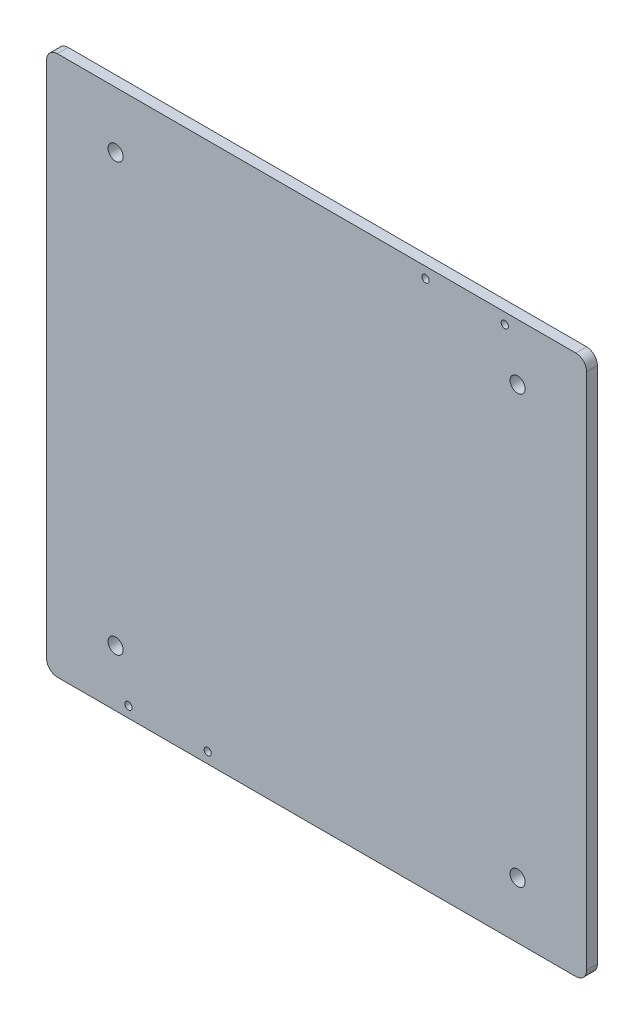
ISO-10303-21;
HEADER;
FILE_DESCRIPTION(('STEP AP214'),'2;1');
FILE_NAME('part.step','',(''),(''),'','','');
FILE_SCHEMA(('AUTOMOTIVE_DESIGN { 1 0 10303 214 1 1 1 1 }'));
ENDSEC;
DATA;
#1=APPLICATION_CONTEXT('core data for automotive mechanical design processes');
#2=APPLICATION_PROTOCOL_DEFINITION('international standard','automotive_design',2000,#1);
#3=PRODUCT_CONTEXT('',#1,'mechanical');
#4=PRODUCT('Part','Part','',(#3));
#5=PRODUCT_RELATED_PRODUCT_CATEGORY('part','',(#4));
#6=PRODUCT_DEFINITION_FORMATION('','',#4);
#7=PRODUCT_DEFINITION_CONTEXT('part definition',#1,'design');
#8=PRODUCT_DEFINITION('design','',#6,#7);
#9=PRODUCT_DEFINITION_SHAPE('','',#8);
#10=(LENGTH_UNIT() NAMED_UNIT(*) SI_UNIT(.MILLI.,.METRE.));
#11=(NAMED_UNIT(*) PLANE_ANGLE_UNIT() SI_UNIT($,.RADIAN.));
#12=(NAMED_UNIT(*) SI_UNIT($,.STERADIAN.) SOLID_ANGLE_UNIT());
#13=UNCERTAINTY_MEASURE_WITH_UNIT(LENGTH_MEASURE(1.E-05),#10,'distance_accuracy_value','');
#14=(GEOMETRIC_REPRESENTATION_CONTEXT(3) GLOBAL_UNCERTAINTY_ASSIGNED_CONTEXT((#13)) GLOBAL_UNIT_ASSIGNED_CONTEXT((#10,
#11,#12)) REPRESENTATION_CONTEXT('',''));
#15=CARTESIAN_POINT('',(0.,0.,0.));
#16=DIRECTION('',(0.,0.,1.));
#17=DIRECTION('',(1.,0.,0.));
#18=AXIS2_PLACEMENT_3D('',#15,#16,#17);
#19=CARTESIAN_POINT('',(75.,-75.,3.));
#20=DIRECTION('',(-1.,0.,0.));
#21=DIRECTION('',(0.,0.,1.));
#22=AXIS2_PLACEMENT_3D('',#19,#20,#21);
#23=PLANE('',#22);
#24=DIRECTION('',(0.,1.,0.));
#25=VECTOR('',#24,1.);
#26=CARTESIAN_POINT('',(75.,-75.,3.));
#27=LINE('',#26,#25);
#28=CARTESIAN_POINT('',(75.,-72.,3.));
#29=VERTEX_POINT('',#28);
#30=CARTESIAN_POINT('',(75.,72.,3.));
#31=VERTEX_POINT('',#30);
#32=EDGE_CURVE('E121',#29,#31,#27,.T.);
#33=ORIENTED_EDGE('',*,*,#32,.F.);
#34=DIRECTION('',(0.,0.,-1.));
#35=VECTOR('',#34,1.);
#36=CARTESIAN_POINT('',(75.,-72.,3.));
#37=LINE('',#36,#35);
#38=CARTESIAN_POINT('',(75.,-72.,0.));
#39=VERTEX_POINT('',#38);
#40=EDGE_CURVE('E106',#29,#39,#37,.T.);
#41=ORIENTED_EDGE('',*,*,#40,.T.);
#42=DIRECTION('',(0.,1.,0.));
#43=VECTOR('',#42,1.);
#44=CARTESIAN_POINT('',(75.,-75.,0.));
#45=LINE('',#44,#43);
#46=CARTESIAN_POINT('',(75.,72.,0.));
#47=VERTEX_POINT('',#46);
#48=EDGE_CURVE('E118',#39,#47,#45,.T.);
#49=ORIENTED_EDGE('',*,*,#48,.T.);
#50=DIRECTION('',(0.,0.,-1.));
#51=VECTOR('',#50,1.);
#52=CARTESIAN_POINT('',(75.,72.,3.));
#53=LINE('',#52,#51);
#54=EDGE_CURVE('E123',#47,#31,#53,.F.);
#55=ORIENTED_EDGE('',*,*,#54,.T.);
#56=EDGE_LOOP('',(#33,#41,#49,#55));
#57=FACE_BOUND('',#56,.T.);
#58=ADVANCED_FACE('F36',(#57),#23,.F.);
#59=CARTESIAN_POINT('',(-75.,75.,3.));
#60=DIRECTION('',(0.,-1.,0.));
#61=DIRECTION('',(0.,0.,-1.));
#62=AXIS2_PLACEMENT_3D('',#59,#60,#61);
#63=PLANE('',#62);
#64=DIRECTION('',(-1.,0.,0.));
#65=VECTOR('',#64,1.);
#66=CARTESIAN_POINT('',(-75.,75.,0.));
#67=LINE('',#66,#65);
#68=CARTESIAN_POINT('',(72.,75.,0.));
#69=VERTEX_POINT('',#68);
#70=CARTESIAN_POINT('',(-72.,75.,0.));
#71=VERTEX_POINT('',#70);
#72=EDGE_CURVE('E127',#69,#71,#67,.T.);
#73=ORIENTED_EDGE('',*,*,#72,.T.);
#74=DIRECTION('',(0.,0.,-1.));
#75=VECTOR('',#74,1.);
#76=CARTESIAN_POINT('',(-72.,75.,3.));
#77=LINE('',#76,#75);
#78=CARTESIAN_POINT('',(-72.,75.,3.));
#79=VERTEX_POINT('',#78);
#80=EDGE_CURVE('E11',#71,#79,#77,.F.);
#81=ORIENTED_EDGE('',*,*,#80,.T.);
#82=DIRECTION('',(-1.,0.,0.));
#83=VECTOR('',#82,1.);
#84=CARTESIAN_POINT('',(-75.,75.,3.));
#85=LINE('',#84,#83);
#86=CARTESIAN_POINT('',(72.,75.,3.));
#87=VERTEX_POINT('',#86);
#88=EDGE_CURVE('E167',#87,#79,#85,.T.);
#89=ORIENTED_EDGE('',*,*,#88,.F.);
#90=DIRECTION('',(0.,0.,-1.));
#91=VECTOR('',#90,1.);
#92=CARTESIAN_POINT('',(72.,75.,3.));
#93=LINE('',#92,#91);
#94=EDGE_CURVE('E44',#87,#69,#93,.T.);
#95=ORIENTED_EDGE('',*,*,#94,.T.);
#96=EDGE_LOOP('',(#73,#81,#89,#95));
#97=FACE_BOUND('',#96,.T.);
#98=ADVANCED_FACE('F165',(#97),#63,.F.);
#99=CARTESIAN_POINT('',(-75.,-75.,3.));
#100=DIRECTION('',(1.,0.,0.));
#101=DIRECTION('',(0.,0.,-1.));
#102=AXIS2_PLACEMENT_3D('',#99,#100,#101);
#103=PLANE('',#102);
#104=DIRECTION('',(0.,-1.,0.));
#105=VECTOR('',#104,1.);
#106=CARTESIAN_POINT('',(-75.,-75.,0.));
#107=LINE('',#106,#105);
#108=CARTESIAN_POINT('',(-75.,72.,0.));
#109=VERTEX_POINT('',#108);
#110=CARTESIAN_POINT('',(-75.,-72.,0.));
#111=VERTEX_POINT('',#110);
#112=EDGE_CURVE('E131',#109,#111,#107,.T.);
#113=ORIENTED_EDGE('',*,*,#112,.T.);
#114=DIRECTION('',(0.,0.,-1.));
#115=VECTOR('',#114,1.);
#116=CARTESIAN_POINT('',(-75.,-72.,3.));
#117=LINE('',#116,#115);
#118=CARTESIAN_POINT('',(-75.,-72.,3.));
#119=VERTEX_POINT('',#118);
#120=EDGE_CURVE('E51',#111,#119,#117,.F.);
#121=ORIENTED_EDGE('',*,*,#120,.T.);
#122=DIRECTION('',(0.,-1.,0.));
#123=VECTOR('',#122,1.);
#124=CARTESIAN_POINT('',(-75.,-75.,3.));
#125=LINE('',#124,#123);
#126=CARTESIAN_POINT('',(-75.,72.,3.));
#127=VERTEX_POINT('',#126);
#128=EDGE_CURVE('E175',#127,#119,#125,.T.);
#129=ORIENTED_EDGE('',*,*,#128,.F.);
#130=DIRECTION('',(0.,0.,-1.));
#131=VECTOR('',#130,1.);
#132=CARTESIAN_POINT('',(-75.,72.,3.));
#133=LINE('',#132,#131);
#134=EDGE_CURVE('E158',#127,#109,#133,.T.);
#135=ORIENTED_EDGE('',*,*,#134,.T.);
#136=EDGE_LOOP('',(#113,#121,#129,#135));
#137=FACE_BOUND('',#136,.T.);
#138=ADVANCED_FACE('F174',(#137),#103,.F.);
#139=CARTESIAN_POINT('',(-75.,-75.,3.));
#140=DIRECTION('',(0.,1.,0.));
#141=DIRECTION('',(0.,0.,1.));
#142=AXIS2_PLACEMENT_3D('',#139,#140,#141);
#143=PLANE('',#142);
#144=DIRECTION('',(1.,0.,0.));
#145=VECTOR('',#144,1.);
#146=CARTESIAN_POINT('',(-75.,-75.,0.));
#147=LINE('',#146,#145);
#148=CARTESIAN_POINT('',(-72.,-75.,0.));
#149=VERTEX_POINT('',#148);
#150=CARTESIAN_POINT('',(72.,-75.,0.));
#151=VERTEX_POINT('',#150);
#152=EDGE_CURVE('E141',#149,#151,#147,.T.);
#153=ORIENTED_EDGE('',*,*,#152,.T.);
#154=DIRECTION('',(0.,0.,-1.));
#155=VECTOR('',#154,1.);
#156=CARTESIAN_POINT('',(72.,-75.,3.));
#157=LINE('',#156,#155);
#158=CARTESIAN_POINT('',(72.,-75.,3.));
#159=VERTEX_POINT('',#158);
#160=EDGE_CURVE('E107',#151,#159,#157,.F.);
#161=ORIENTED_EDGE('',*,*,#160,.T.);
#162=DIRECTION('',(1.,0.,0.));
#163=VECTOR('',#162,1.);
#164=CARTESIAN_POINT('',(-75.,-75.,3.));
#165=LINE('',#164,#163);
#166=CARTESIAN_POINT('',(-72.,-75.,3.));
#167=VERTEX_POINT('',#166);
#168=EDGE_CURVE('E137',#167,#159,#165,.T.);
#169=ORIENTED_EDGE('',*,*,#168,.F.);
#170=DIRECTION('',(0.,0.,-1.));
#171=VECTOR('',#170,1.);
#172=CARTESIAN_POINT('',(-72.,-75.,3.));
#173=LINE('',#172,#171);
#174=EDGE_CURVE('E112',#167,#149,#173,.T.);
#175=ORIENTED_EDGE('',*,*,#174,.T.);
#176=EDGE_LOOP('',(#153,#161,#169,#175));
#177=FACE_BOUND('',#176,.T.);
#178=ADVANCED_FACE('F327',(#177),#143,.F.);
#179=CARTESIAN_POINT('',(0.,0.,3.));
#180=DIRECTION('',(0.,0.,-1.));
#181=DIRECTION('',(-1.,0.,0.));
#182=AXIS2_PLACEMENT_3D('',#179,#180,#181);
#183=PLANE('',#182);
#184=CARTESIAN_POINT('',(52.26,72.,3.));
#185=DIRECTION('',(0.,0.,-1.));
#186=DIRECTION('',(-1.,0.,0.));
#187=AXIS2_PLACEMENT_3D('',#184,#185,#186);
#188=CIRCLE('',#187,0.999999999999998);
#189=CARTESIAN_POINT('',(51.26,72.,3.));
#190=VERTEX_POINT('',#189);
#191=EDGE_CURVE('E201',#190,#190,#188,.F.);
#192=ORIENTED_EDGE('',*,*,#191,.F.);
#193=EDGE_LOOP('',(#192));
#194=FACE_BOUND('',#193,.T.);
#195=CARTESIAN_POINT('',(-30.26,-72.,3.));
#196=DIRECTION('',(0.,0.,-1.));
#197=DIRECTION('',(-1.,0.,0.));
#198=AXIS2_PLACEMENT_3D('',#195,#196,#197);
#199=CIRCLE('',#198,1.);
#200=CARTESIAN_POINT('',(-31.26,-72.,3.));
#201=VERTEX_POINT('',#200);
#202=EDGE_CURVE('E218',#201,#201,#199,.F.);
#203=ORIENTED_EDGE('',*,*,#202,.F.);
#204=EDGE_LOOP('',(#203));
#205=FACE_BOUND('',#204,.T.);
#206=CARTESIAN_POINT('',(-52.26,-72.,3.));
#207=DIRECTION('',(0.,0.,-1.));
#208=DIRECTION('',(-1.,0.,0.));
#209=AXIS2_PLACEMENT_3D('',#206,#207,#208);
#210=CIRCLE('',#209,0.999999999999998);
#211=CARTESIAN_POINT('',(-53.26,-72.,3.));
#212=VERTEX_POINT('',#211);
#213=EDGE_CURVE('E206',#212,#212,#210,.F.);
#214=ORIENTED_EDGE('',*,*,#213,.F.);
#215=EDGE_LOOP('',(#214));
#216=FACE_BOUND('',#215,.T.);
#217=CARTESIAN_POINT('',(30.26,72.,3.));
#218=DIRECTION('',(0.,0.,-1.));
#219=DIRECTION('',(-1.,0.,0.));
#220=AXIS2_PLACEMENT_3D('',#217,#218,#219);
#221=CIRCLE('',#220,1.);
#222=CARTESIAN_POINT('',(29.26,72.,3.));
#223=VERTEX_POINT('',#222);
#224=EDGE_CURVE('E205',#223,#223,#221,.F.);
#225=ORIENTED_EDGE('',*,*,#224,.F.);
#226=EDGE_LOOP('',(#225));
#227=FACE_BOUND('',#226,.T.);
#228=CARTESIAN_POINT('',(-55.835,59.325,3.));
#229=DIRECTION('',(0.,0.,-1.));
#230=DIRECTION('',(-1.,0.,0.));
#231=AXIS2_PLACEMENT_3D('',#228,#229,#230);
#232=CIRCLE('',#231,2.1);
#233=CARTESIAN_POINT('',(-57.935,59.325,3.));
#234=VERTEX_POINT('',#233);
#235=EDGE_CURVE('E187',#234,#234,#232,.F.);
#236=ORIENTED_EDGE('',*,*,#235,.F.);
#237=EDGE_LOOP('',(#236));
#238=FACE_BOUND('',#237,.T.);
#239=CARTESIAN_POINT('',(55.835,-59.325,3.));
#240=DIRECTION('',(0.,0.,-1.));
#241=DIRECTION('',(-1.,0.,0.));
#242=AXIS2_PLACEMENT_3D('',#239,#240,#241);
#243=CIRCLE('',#242,2.1);
#244=CARTESIAN_POINT('',(53.735,-59.325,3.));
#245=VERTEX_POINT('',#244);
#246=EDGE_CURVE('E188',#245,#245,#243,.F.);
#247=ORIENTED_EDGE('',*,*,#246,.F.);
#248=EDGE_LOOP('',(#247));
#249=FACE_BOUND('',#248,.T.);
#250=CARTESIAN_POINT('',(-55.835,-59.325,3.));
#251=DIRECTION('',(0.,0.,-1.));
#252=DIRECTION('',(-1.,0.,0.));
#253=AXIS2_PLACEMENT_3D('',#250,#251,#252);
#254=CIRCLE('',#253,2.1);
#255=CARTESIAN_POINT('',(-57.935,-59.325,3.));
#256=VERTEX_POINT('',#255);
#257=EDGE_CURVE('E198',#256,#256,#254,.F.);
#258=ORIENTED_EDGE('',*,*,#257,.F.);
#259=EDGE_LOOP('',(#258));
#260=FACE_BOUND('',#259,.T.);
#261=CARTESIAN_POINT('',(55.835,59.325,3.));
#262=DIRECTION('',(0.,0.,-1.));
#263=DIRECTION('',(-1.,0.,0.));
#264=AXIS2_PLACEMENT_3D('',#261,#262,#263);
#265=CIRCLE('',#264,2.1);
#266=CARTESIAN_POINT('',(53.735,59.325,3.));
#267=VERTEX_POINT('',#266);
#268=EDGE_CURVE('E128',#267,#267,#265,.F.);
#269=ORIENTED_EDGE('',*,*,#268,.F.);
#270=EDGE_LOOP('',(#269));
#271=FACE_BOUND('',#270,.T.);
#272=ORIENTED_EDGE('',*,*,#168,.T.);
#273=CARTESIAN_POINT('',(72.,-72.,3.));
#274=DIRECTION('',(0.,0.,-1.));
#275=DIRECTION('',(-1.,0.,0.));
#276=AXIS2_PLACEMENT_3D('',#273,#274,#275);
#277=CIRCLE('',#276,3.);
#278=EDGE_CURVE('E156',#159,#29,#277,.F.);
#279=ORIENTED_EDGE('',*,*,#278,.T.);
#280=ORIENTED_EDGE('',*,*,#32,.T.);
#281=CARTESIAN_POINT('',(72.,72.,3.));
#282=DIRECTION('',(0.,0.,-1.));
#283=DIRECTION('',(-1.,0.,0.));
#284=AXIS2_PLACEMENT_3D('',#281,#282,#283);
#285=CIRCLE('',#284,3.);
#286=EDGE_CURVE('E151',#31,#87,#285,.F.);
#287=ORIENTED_EDGE('',*,*,#286,.T.);
#288=ORIENTED_EDGE('',*,*,#88,.T.);
#289=CARTESIAN_POINT('',(-72.,72.,3.));
#290=DIRECTION('',(0.,0.,-1.));
#291=DIRECTION('',(-1.,0.,0.));
#292=AXIS2_PLACEMENT_3D('',#289,#290,#291);
#293=CIRCLE('',#292,3.);
#294=EDGE_CURVE('E58',#79,#127,#293,.F.);
#295=ORIENTED_EDGE('',*,*,#294,.T.);
#296=ORIENTED_EDGE('',*,*,#128,.T.);
#297=CARTESIAN_POINT('',(-72.,-72.,3.));
#298=DIRECTION('',(0.,0.,-1.));
#299=DIRECTION('',(-1.,0.,0.));
#300=AXIS2_PLACEMENT_3D('',#297,#298,#299);
#301=CIRCLE('',#300,3.);
#302=EDGE_CURVE('E154',#119,#167,#301,.F.);
#303=ORIENTED_EDGE('',*,*,#302,.T.);
#304=EDGE_LOOP('',(#272,#279,#280,#287,#288,#295,#296,#303));
#305=FACE_BOUND('',#304,.T.);
#306=ADVANCED_FACE('F230',(#194,#205,#216,#227,#238,#249,#260,#271,#305),#183,.F.);
#307=CARTESIAN_POINT('',(0.,0.,0.));
#308=DIRECTION('',(0.,0.,-1.));
#309=DIRECTION('',(-1.,0.,0.));
#310=AXIS2_PLACEMENT_3D('',#307,#308,#309);
#311=PLANE('',#310);
#312=CARTESIAN_POINT('',(52.26,72.,0.));
#313=DIRECTION('',(0.,0.,-1.));
#314=DIRECTION('',(-1.,0.,0.));
#315=AXIS2_PLACEMENT_3D('',#312,#313,#314);
#316=CIRCLE('',#315,0.999999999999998);
#317=CARTESIAN_POINT('',(51.26,72.,0.));
#318=VERTEX_POINT('',#317);
#319=EDGE_CURVE('E213',#318,#318,#316,.T.);
#320=ORIENTED_EDGE('',*,*,#319,.F.);
#321=EDGE_LOOP('',(#320));
#322=FACE_BOUND('',#321,.T.);
#323=CARTESIAN_POINT('',(-30.26,-72.,0.));
#324=DIRECTION('',(0.,0.,-1.));
#325=DIRECTION('',(-1.,0.,0.));
#326=AXIS2_PLACEMENT_3D('',#323,#324,#325);
#327=CIRCLE('',#326,1.);
#328=CARTESIAN_POINT('',(-31.26,-72.,0.));
#329=VERTEX_POINT('',#328);
#330=EDGE_CURVE('E209',#329,#329,#327,.T.);
#331=ORIENTED_EDGE('',*,*,#330,.F.);
#332=EDGE_LOOP('',(#331));
#333=FACE_BOUND('',#332,.T.);
#334=CARTESIAN_POINT('',(-52.26,-72.,0.));
#335=DIRECTION('',(0.,0.,-1.));
#336=DIRECTION('',(-1.,0.,0.));
#337=AXIS2_PLACEMENT_3D('',#334,#335,#336);
#338=CIRCLE('',#337,0.999999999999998);
#339=CARTESIAN_POINT('',(-53.26,-72.,0.));
#340=VERTEX_POINT('',#339);
#341=EDGE_CURVE('E202',#340,#340,#338,.T.);
#342=ORIENTED_EDGE('',*,*,#341,.F.);
#343=EDGE_LOOP('',(#342));
#344=FACE_BOUND('',#343,.T.);
#345=CARTESIAN_POINT('',(30.26,72.,0.));
#346=DIRECTION('',(0.,0.,-1.));
#347=DIRECTION('',(-1.,0.,0.));
#348=AXIS2_PLACEMENT_3D('',#345,#346,#347);
#349=CIRCLE('',#348,1.);
#350=CARTESIAN_POINT('',(29.26,72.,0.));
#351=VERTEX_POINT('',#350);
#352=EDGE_CURVE('E210',#351,#351,#349,.T.);
#353=ORIENTED_EDGE('',*,*,#352,.F.);
#354=EDGE_LOOP('',(#353));
#355=FACE_BOUND('',#354,.T.);
#356=CARTESIAN_POINT('',(-55.835,59.325,0.));
#357=DIRECTION('',(0.,0.,-1.));
#358=DIRECTION('',(-1.,0.,0.));
#359=AXIS2_PLACEMENT_3D('',#356,#357,#358);
#360=CIRCLE('',#359,2.1);
#361=CARTESIAN_POINT('',(-57.935,59.325,0.));
#362=VERTEX_POINT('',#361);
#363=EDGE_CURVE('E183',#362,#362,#360,.T.);
#364=ORIENTED_EDGE('',*,*,#363,.F.);
#365=EDGE_LOOP('',(#364));
#366=FACE_BOUND('',#365,.T.);
#367=CARTESIAN_POINT('',(55.835,-59.325,0.));
#368=DIRECTION('',(0.,0.,-1.));
#369=DIRECTION('',(-1.,0.,0.));
#370=AXIS2_PLACEMENT_3D('',#367,#368,#369);
#371=CIRCLE('',#370,2.1);
#372=CARTESIAN_POINT('',(53.735,-59.325,0.));
#373=VERTEX_POINT('',#372);
#374=EDGE_CURVE('E184',#373,#373,#371,.T.);
#375=ORIENTED_EDGE('',*,*,#374,.F.);
#376=EDGE_LOOP('',(#375));
#377=FACE_BOUND('',#376,.T.);
#378=CARTESIAN_POINT('',(-55.835,-59.325,0.));
#379=DIRECTION('',(0.,0.,-1.));
#380=DIRECTION('',(-1.,0.,0.));
#381=AXIS2_PLACEMENT_3D('',#378,#379,#380);
#382=CIRCLE('',#381,2.1);
#383=CARTESIAN_POINT('',(-57.935,-59.325,0.));
#384=VERTEX_POINT('',#383);
#385=EDGE_CURVE('E191',#384,#384,#382,.T.);
#386=ORIENTED_EDGE('',*,*,#385,.F.);
#387=EDGE_LOOP('',(#386));
#388=FACE_BOUND('',#387,.T.);
#389=CARTESIAN_POINT('',(55.835,59.325,0.));
#390=DIRECTION('',(0.,0.,-1.));
#391=DIRECTION('',(-1.,0.,0.));
#392=AXIS2_PLACEMENT_3D('',#389,#390,#391);
#393=CIRCLE('',#392,2.1);
#394=CARTESIAN_POINT('',(53.735,59.325,0.));
#395=VERTEX_POINT('',#394);
#396=EDGE_CURVE('E134',#395,#395,#393,.T.);
#397=ORIENTED_EDGE('',*,*,#396,.F.);
#398=EDGE_LOOP('',(#397));
#399=FACE_BOUND('',#398,.T.);
#400=ORIENTED_EDGE('',*,*,#48,.F.);
#401=CARTESIAN_POINT('',(72.,-72.,0.));
#402=DIRECTION('',(0.,0.,-1.));
#403=DIRECTION('',(-1.,0.,0.));
#404=AXIS2_PLACEMENT_3D('',#401,#402,#403);
#405=CIRCLE('',#404,3.);
#406=EDGE_CURVE('E102',#39,#151,#405,.T.);
#407=ORIENTED_EDGE('',*,*,#406,.T.);
#408=ORIENTED_EDGE('',*,*,#152,.F.);
#409=CARTESIAN_POINT('',(-72.,-72.,0.));
#410=DIRECTION('',(0.,0.,-1.));
#411=DIRECTION('',(-1.,0.,0.));
#412=AXIS2_PLACEMENT_3D('',#409,#410,#411);
#413=CIRCLE('',#412,3.);
#414=EDGE_CURVE('E113',#149,#111,#413,.T.);
#415=ORIENTED_EDGE('',*,*,#414,.T.);
#416=ORIENTED_EDGE('',*,*,#112,.F.);
#417=CARTESIAN_POINT('',(-72.,72.,0.));
#418=DIRECTION('',(0.,0.,-1.));
#419=DIRECTION('',(-1.,0.,0.));
#420=AXIS2_PLACEMENT_3D('',#417,#418,#419);
#421=CIRCLE('',#420,3.);
#422=EDGE_CURVE('E145',#109,#71,#421,.T.);
#423=ORIENTED_EDGE('',*,*,#422,.T.);
#424=ORIENTED_EDGE('',*,*,#72,.F.);
#425=CARTESIAN_POINT('',(72.,72.,0.));
#426=DIRECTION('',(0.,0.,-1.));
#427=DIRECTION('',(-1.,0.,0.));
#428=AXIS2_PLACEMENT_3D('',#425,#426,#427);
#429=CIRCLE('',#428,3.);
#430=EDGE_CURVE('E122',#69,#47,#429,.T.);
#431=ORIENTED_EDGE('',*,*,#430,.T.);
#432=EDGE_LOOP('',(#400,#407,#408,#415,#416,#423,#424,#431));
#433=FACE_BOUND('',#432,.T.);
#434=ADVANCED_FACE('F125',(#322,#333,#344,#355,#366,#377,#388,#399,#433),#311,.T.);
#435=CARTESIAN_POINT('',(72.,-72.,3.));
#436=DIRECTION('',(0.,0.,-1.));
#437=DIRECTION('',(-1.,0.,0.));
#438=AXIS2_PLACEMENT_3D('',#435,#436,#437);
#439=CYLINDRICAL_SURFACE('',#438,3.);
#440=ORIENTED_EDGE('',*,*,#278,.F.);
#441=ORIENTED_EDGE('',*,*,#160,.F.);
#442=ORIENTED_EDGE('',*,*,#406,.F.);
#443=ORIENTED_EDGE('',*,*,#40,.F.);
#444=EDGE_LOOP('',(#440,#441,#442,#443));
#445=FACE_BOUND('',#444,.T.);
#446=ADVANCED_FACE('F105',(#445),#439,.T.);
#447=CARTESIAN_POINT('',(-72.,-72.,3.));
#448=DIRECTION('',(0.,0.,-1.));
#449=DIRECTION('',(-1.,0.,0.));
#450=AXIS2_PLACEMENT_3D('',#447,#448,#449);
#451=CYLINDRICAL_SURFACE('',#450,3.);
#452=ORIENTED_EDGE('',*,*,#302,.F.);
#453=ORIENTED_EDGE('',*,*,#120,.F.);
#454=ORIENTED_EDGE('',*,*,#414,.F.);
#455=ORIENTED_EDGE('',*,*,#174,.F.);
#456=EDGE_LOOP('',(#452,#453,#454,#455));
#457=FACE_BOUND('',#456,.T.);
#458=ADVANCED_FACE('F270',(#457),#451,.T.);
#459=CARTESIAN_POINT('',(-72.,72.,3.));
#460=DIRECTION('',(0.,0.,-1.));
#461=DIRECTION('',(-1.,0.,0.));
#462=AXIS2_PLACEMENT_3D('',#459,#460,#461);
#463=CYLINDRICAL_SURFACE('',#462,3.);
#464=ORIENTED_EDGE('',*,*,#294,.F.);
#465=ORIENTED_EDGE('',*,*,#80,.F.);
#466=ORIENTED_EDGE('',*,*,#422,.F.);
#467=ORIENTED_EDGE('',*,*,#134,.F.);
#468=EDGE_LOOP('',(#464,#465,#466,#467));
#469=FACE_BOUND('',#468,.T.);
#470=ADVANCED_FACE('F173',(#469),#463,.T.);
#471=CARTESIAN_POINT('',(72.,72.,3.));
#472=DIRECTION('',(0.,0.,-1.));
#473=DIRECTION('',(-1.,0.,0.));
#474=AXIS2_PLACEMENT_3D('',#471,#472,#473);
#475=CYLINDRICAL_SURFACE('',#474,3.);
#476=ORIENTED_EDGE('',*,*,#286,.F.);
#477=ORIENTED_EDGE('',*,*,#54,.F.);
#478=ORIENTED_EDGE('',*,*,#430,.F.);
#479=ORIENTED_EDGE('',*,*,#94,.F.);
#480=EDGE_LOOP('',(#476,#477,#478,#479));
#481=FACE_BOUND('',#480,.T.);
#482=ADVANCED_FACE('F38',(#481),#475,.T.);
#483=CARTESIAN_POINT('',(55.835,59.325,8.93969696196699));
#484=DIRECTION('',(0.,0.,-1.));
#485=DIRECTION('',(-1.,0.,0.));
#486=AXIS2_PLACEMENT_3D('',#483,#484,#485);
#487=CYLINDRICAL_SURFACE('',#486,2.1);
#488=ORIENTED_EDGE('',*,*,#268,.T.);
#489=EDGE_LOOP('',(#488));
#490=FACE_BOUND('',#489,.T.);
#491=ORIENTED_EDGE('',*,*,#396,.T.);
#492=EDGE_LOOP('',(#491));
#493=FACE_BOUND('',#492,.T.);
#494=ADVANCED_FACE('F246',(#490,#493),#487,.F.);
#495=CARTESIAN_POINT('',(-55.835,-59.325,8.93969696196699));
#496=DIRECTION('',(0.,0.,-1.));
#497=DIRECTION('',(-1.,0.,0.));
#498=AXIS2_PLACEMENT_3D('',#495,#496,#497);
#499=CYLINDRICAL_SURFACE('',#498,2.1);
#500=ORIENTED_EDGE('',*,*,#257,.T.);
#501=EDGE_LOOP('',(#500));
#502=FACE_BOUND('',#501,.T.);
#503=ORIENTED_EDGE('',*,*,#385,.T.);
#504=EDGE_LOOP('',(#503));
#505=FACE_BOUND('',#504,.T.);
#506=ADVANCED_FACE('F248',(#502,#505),#499,.F.);
#507=CARTESIAN_POINT('',(55.835,-59.325,8.93969696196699));
#508=DIRECTION('',(0.,0.,-1.));
#509=DIRECTION('',(-1.,0.,0.));
#510=AXIS2_PLACEMENT_3D('',#507,#508,#509);
#511=CYLINDRICAL_SURFACE('',#510,2.1);
#512=ORIENTED_EDGE('',*,*,#246,.T.);
#513=EDGE_LOOP('',(#512));
#514=FACE_BOUND('',#513,.T.);
#515=ORIENTED_EDGE('',*,*,#374,.T.);
#516=EDGE_LOOP('',(#515));
#517=FACE_BOUND('',#516,.T.);
#518=ADVANCED_FACE('F255',(#514,#517),#511,.F.);
#519=CARTESIAN_POINT('',(-55.835,59.325,8.93969696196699));
#520=DIRECTION('',(0.,0.,-1.));
#521=DIRECTION('',(-1.,0.,0.));
#522=AXIS2_PLACEMENT_3D('',#519,#520,#521);
#523=CYLINDRICAL_SURFACE('',#522,2.1);
#524=ORIENTED_EDGE('',*,*,#235,.T.);
#525=EDGE_LOOP('',(#524));
#526=FACE_BOUND('',#525,.T.);
#527=ORIENTED_EDGE('',*,*,#363,.T.);
#528=EDGE_LOOP('',(#527));
#529=FACE_BOUND('',#528,.T.);
#530=ADVANCED_FACE('F304',(#526,#529),#523,.F.);
#531=CARTESIAN_POINT('',(30.26,72.,5.82842712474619));
#532=DIRECTION('',(0.,0.,-1.));
#533=DIRECTION('',(-1.,0.,0.));
#534=AXIS2_PLACEMENT_3D('',#531,#532,#533);
#535=CYLINDRICAL_SURFACE('',#534,1.);
#536=CARTESIAN_POINT('',(29.26,72.,3.));
#537=CARTESIAN_POINT('',(29.26,72.,2.96875));
#538=CARTESIAN_POINT('',(29.26,72.,2.9375));
#539=CARTESIAN_POINT('',(29.26,72.,2.875));
#540=CARTESIAN_POINT('',(29.26,72.,2.84375));
#541=CARTESIAN_POINT('',(29.26,72.,2.78125));
#542=CARTESIAN_POINT('',(29.26,72.,2.75));
#543=CARTESIAN_POINT('',(29.26,72.,2.6875));
#544=CARTESIAN_POINT('',(29.26,72.,2.65625));
#545=CARTESIAN_POINT('',(29.26,72.,2.59375));
#546=CARTESIAN_POINT('',(29.26,72.,2.5625));
#547=CARTESIAN_POINT('',(29.26,72.,2.5));
#548=CARTESIAN_POINT('',(29.26,72.,2.46875));
#549=CARTESIAN_POINT('',(29.26,72.,2.40625));
#550=CARTESIAN_POINT('',(29.26,72.,2.375));
#551=CARTESIAN_POINT('',(29.26,72.,2.3125));
#552=CARTESIAN_POINT('',(29.26,72.,2.28125));
#553=CARTESIAN_POINT('',(29.26,72.,2.21875));
#554=CARTESIAN_POINT('',(29.26,72.,2.1875));
#555=CARTESIAN_POINT('',(29.26,72.,2.125));
#556=CARTESIAN_POINT('',(29.26,72.,2.09375));
#557=CARTESIAN_POINT('',(29.26,72.,2.03125));
#558=CARTESIAN_POINT('',(29.26,72.,2.));
#559=CARTESIAN_POINT('',(29.26,72.,1.9375));
#560=CARTESIAN_POINT('',(29.26,72.,1.90625));
#561=CARTESIAN_POINT('',(29.26,72.,1.84375));
#562=CARTESIAN_POINT('',(29.26,72.,1.8125));
#563=CARTESIAN_POINT('',(29.26,72.,1.75));
#564=CARTESIAN_POINT('',(29.26,72.,1.71875));
#565=CARTESIAN_POINT('',(29.26,72.,1.65625));
#566=CARTESIAN_POINT('',(29.26,72.,1.625));
#567=CARTESIAN_POINT('',(29.26,72.,1.5625));
#568=CARTESIAN_POINT('',(29.26,72.,1.53125));
#569=CARTESIAN_POINT('',(29.26,72.,1.46875));
#570=CARTESIAN_POINT('',(29.26,72.,1.4375));
#571=CARTESIAN_POINT('',(29.26,72.,1.375));
#572=CARTESIAN_POINT('',(29.26,72.,1.34375));
#573=CARTESIAN_POINT('',(29.26,72.,1.28125));
#574=CARTESIAN_POINT('',(29.26,72.,1.25));
#575=CARTESIAN_POINT('',(29.26,72.,1.1875));
#576=CARTESIAN_POINT('',(29.26,72.,1.15625));
#577=CARTESIAN_POINT('',(29.26,72.,1.09375));
#578=CARTESIAN_POINT('',(29.26,72.,1.0625));
#579=CARTESIAN_POINT('',(29.26,72.,1.));
#580=CARTESIAN_POINT('',(29.26,72.,0.968750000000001));
#581=CARTESIAN_POINT('',(29.26,72.,0.906250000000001));
#582=CARTESIAN_POINT('',(29.26,72.,0.875000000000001));
#583=CARTESIAN_POINT('',(29.26,72.,0.812500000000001));
#584=CARTESIAN_POINT('',(29.26,72.,0.781250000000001));
#585=CARTESIAN_POINT('',(29.26,72.,0.718750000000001));
#586=CARTESIAN_POINT('',(29.26,72.,0.687500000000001));
#587=CARTESIAN_POINT('',(29.26,72.,0.625000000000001));
#588=CARTESIAN_POINT('',(29.26,72.,0.593750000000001));
#589=CARTESIAN_POINT('',(29.26,72.,0.53125));
#590=CARTESIAN_POINT('',(29.26,72.,0.5));
#591=CARTESIAN_POINT('',(29.26,72.,0.4375));
#592=CARTESIAN_POINT('',(29.26,72.,0.40625));
#593=CARTESIAN_POINT('',(29.26,72.,0.34375));
#594=CARTESIAN_POINT('',(29.26,72.,0.3125));
#595=CARTESIAN_POINT('',(29.26,72.,0.25));
#596=CARTESIAN_POINT('',(29.26,72.,0.21875));
#597=CARTESIAN_POINT('',(29.26,72.,0.15625));
#598=CARTESIAN_POINT('',(29.26,72.,0.125));
#599=CARTESIAN_POINT('',(29.26,72.,0.0625000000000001));
#600=CARTESIAN_POINT('',(29.26,72.,0.03125));
#601=CARTESIAN_POINT('',(29.26,72.,0.));
#602=B_SPLINE_CURVE_WITH_KNOTS('',3,(#536,#537,#538,#539,#540,#541,#542,#543,#544,#545,#546,
#547,#548,#549,#550,#551,#552,#553,#554,#555,#556,#557,#558,#559,#560,#561,#562,#563,#564,#565,
#566,#567,#568,#569,#570,#571,#572,#573,#574,#575,#576,#577,#578,#579,#580,#581,#582,#583,#584,
#585,#586,#587,#588,#589,#590,#591,#592,#593,#594,#595,#596,#597,#598,#599,#600,#601),
.UNSPECIFIED.,.F.,.F.,(4,2,2,2,2,2,2,2,2,2,2,2,2,2,2,2,2,2,2,2,2,2,2,2,2,2,2,2,2,2,2,2,4),(0.,
0.0937500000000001,0.1875,0.28125,0.375,0.46875,0.5625,0.65625,0.75,0.84375,0.9375,1.03125,
1.125,1.21875,1.3125,1.40625,1.5,1.59375,1.6875,1.78125,1.875,1.96875,2.0625,2.15625,2.25,
2.34375,2.4375,2.53125,2.625,2.71875,2.8125,2.90625,3.),.UNSPECIFIED.);
#603=EDGE_CURVE('BSEAM314',#223,#351,#602,.T.);
#604=ORIENTED_EDGE('',*,*,#224,.T.);
#605=ORIENTED_EDGE('',*,*,#352,.T.);
#606=ORIENTED_EDGE('',*,*,#603,.T.);
#607=ORIENTED_EDGE('',*,*,#603,.F.);
#608=EDGE_LOOP('',(#604,#606,#605,#607));
#609=FACE_BOUND('',#608,.T.);
#610=ADVANCED_FACE('F314',(#609),#535,.F.);
#611=CARTESIAN_POINT('',(-52.26,-72.,5.82842712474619));
#612=DIRECTION('',(0.,0.,-1.));
#613=DIRECTION('',(-1.,0.,0.));
#614=AXIS2_PLACEMENT_3D('',#611,#612,#613);
#615=CYLINDRICAL_SURFACE('',#614,0.999999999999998);
#616=CARTESIAN_POINT('',(-53.26,-72.,3.));
#617=CARTESIAN_POINT('',(-53.26,-72.,2.96875));
#618=CARTESIAN_POINT('',(-53.26,-72.,2.9375));
#619=CARTESIAN_POINT('',(-53.26,-72.,2.875));
#620=CARTESIAN_POINT('',(-53.26,-72.,2.84375));
#621=CARTESIAN_POINT('',(-53.26,-72.,2.78125));
#622=CARTESIAN_POINT('',(-53.26,-72.,2.75));
#623=CARTESIAN_POINT('',(-53.26,-72.,2.6875));
#624=CARTESIAN_POINT('',(-53.26,-72.,2.65625));
#625=CARTESIAN_POINT('',(-53.26,-72.,2.59375));
#626=CARTESIAN_POINT('',(-53.26,-72.,2.5625));
#627=CARTESIAN_POINT('',(-53.26,-72.,2.5));
#628=CARTESIAN_POINT('',(-53.26,-72.,2.46875));
#629=CARTESIAN_POINT('',(-53.26,-72.,2.40625));
#630=CARTESIAN_POINT('',(-53.26,-72.,2.375));
#631=CARTESIAN_POINT('',(-53.26,-72.,2.3125));
#632=CARTESIAN_POINT('',(-53.26,-72.,2.28125));
#633=CARTESIAN_POINT('',(-53.26,-72.,2.21875));
#634=CARTESIAN_POINT('',(-53.26,-72.,2.1875));
#635=CARTESIAN_POINT('',(-53.26,-72.,2.125));
#636=CARTESIAN_POINT('',(-53.26,-72.,2.09375));
#637=CARTESIAN_POINT('',(-53.26,-72.,2.03125));
#638=CARTESIAN_POINT('',(-53.26,-72.,2.));
#639=CARTESIAN_POINT('',(-53.26,-72.,1.9375));
#640=CARTESIAN_POINT('',(-53.26,-72.,1.90625));
#641=CARTESIAN_POINT('',(-53.26,-72.,1.84375));
#642=CARTESIAN_POINT('',(-53.26,-72.,1.8125));
#643=CARTESIAN_POINT('',(-53.26,-72.,1.75));
#644=CARTESIAN_POINT('',(-53.26,-72.,1.71875));
#645=CARTESIAN_POINT('',(-53.26,-72.,1.65625));
#646=CARTESIAN_POINT('',(-53.26,-72.,1.625));
#647=CARTESIAN_POINT('',(-53.26,-72.,1.5625));
#648=CARTESIAN_POINT('',(-53.26,-72.,1.53125));
#649=CARTESIAN_POINT('',(-53.26,-72.,1.46875));
#650=CARTESIAN_POINT('',(-53.26,-72.,1.4375));
#651=CARTESIAN_POINT('',(-53.26,-72.,1.375));
#652=CARTESIAN_POINT('',(-53.26,-72.,1.34375));
#653=CARTESIAN_POINT('',(-53.26,-72.,1.28125));
#654=CARTESIAN_POINT('',(-53.26,-72.,1.25));
#655=CARTESIAN_POINT('',(-53.26,-72.,1.1875));
#656=CARTESIAN_POINT('',(-53.26,-72.,1.15625));
#657=CARTESIAN_POINT('',(-53.26,-72.,1.09375));
#658=CARTESIAN_POINT('',(-53.26,-72.,1.0625));
#659=CARTESIAN_POINT('',(-53.26,-72.,1.));
#660=CARTESIAN_POINT('',(-53.26,-72.,0.968750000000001));
#661=CARTESIAN_POINT('',(-53.26,-72.,0.906250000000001));
#662=CARTESIAN_POINT('',(-53.26,-72.,0.875000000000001));
#663=CARTESIAN_POINT('',(-53.26,-72.,0.812500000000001));
#664=CARTESIAN_POINT('',(-53.26,-72.,0.781250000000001));
#665=CARTESIAN_POINT('',(-53.26,-72.,0.718750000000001));
#666=CARTESIAN_POINT('',(-53.26,-72.,0.687500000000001));
#667=CARTESIAN_POINT('',(-53.26,-72.,0.625000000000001));
#668=CARTESIAN_POINT('',(-53.26,-72.,0.593750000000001));
#669=CARTESIAN_POINT('',(-53.26,-72.,0.53125));
#670=CARTESIAN_POINT('',(-53.26,-72.,0.5));
#671=CARTESIAN_POINT('',(-53.26,-72.,0.4375));
#672=CARTESIAN_POINT('',(-53.26,-72.,0.40625));
#673=CARTESIAN_POINT('',(-53.26,-72.,0.34375));
#674=CARTESIAN_POINT('',(-53.26,-72.,0.3125));
#675=CARTESIAN_POINT('',(-53.26,-72.,0.25));
#676=CARTESIAN_POINT('',(-53.26,-72.,0.21875));
#677=CARTESIAN_POINT('',(-53.26,-72.,0.15625));
#678=CARTESIAN_POINT('',(-53.26,-72.,0.125));
#679=CARTESIAN_POINT('',(-53.26,-72.,0.0625000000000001));
#680=CARTESIAN_POINT('',(-53.26,-72.,0.03125));
#681=CARTESIAN_POINT('',(-53.26,-72.,0.));
#682=B_SPLINE_CURVE_WITH_KNOTS('',3,(#616,#617,#618,#619,#620,#621,#622,#623,#624,#625,#626,
#627,#628,#629,#630,#631,#632,#633,#634,#635,#636,#637,#638,#639,#640,#641,#642,#643,#644,#645,
#646,#647,#648,#649,#650,#651,#652,#653,#654,#655,#656,#657,#658,#659,#660,#661,#662,#663,#664,
#665,#666,#667,#668,#669,#670,#671,#672,#673,#674,#675,#676,#677,#678,#679,#680,#681),
.UNSPECIFIED.,.F.,.F.,(4,2,2,2,2,2,2,2,2,2,2,2,2,2,2,2,2,2,2,2,2,2,2,2,2,2,2,2,2,2,2,2,4),(0.,
0.0937500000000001,0.1875,0.28125,0.375,0.46875,0.5625,0.65625,0.75,0.84375,0.9375,1.03125,
1.125,1.21875,1.3125,1.40625,1.5,1.59375,1.6875,1.78125,1.875,1.96875,2.0625,2.15625,2.25,
2.34375,2.4375,2.53125,2.625,2.71875,2.8125,2.90625,3.),.UNSPECIFIED.);
#683=EDGE_CURVE('BSEAM345',#212,#340,#682,.T.);
#684=ORIENTED_EDGE('',*,*,#213,.T.);
#685=ORIENTED_EDGE('',*,*,#341,.T.);
#686=ORIENTED_EDGE('',*,*,#683,.T.);
#687=ORIENTED_EDGE('',*,*,#683,.F.);
#688=EDGE_LOOP('',(#684,#686,#685,#687));
#689=FACE_BOUND('',#688,.T.);
#690=ADVANCED_FACE('F345',(#689),#615,.F.);
#691=CARTESIAN_POINT('',(-30.26,-72.,5.82842712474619));
#692=DIRECTION('',(0.,0.,-1.));
#693=DIRECTION('',(-1.,0.,0.));
#694=AXIS2_PLACEMENT_3D('',#691,#692,#693);
#695=CYLINDRICAL_SURFACE('',#694,1.);
#696=CARTESIAN_POINT('',(-31.26,-72.,3.));
#697=CARTESIAN_POINT('',(-31.26,-72.,2.96875));
#698=CARTESIAN_POINT('',(-31.26,-72.,2.9375));
#699=CARTESIAN_POINT('',(-31.26,-72.,2.875));
#700=CARTESIAN_POINT('',(-31.26,-72.,2.84375));
#701=CARTESIAN_POINT('',(-31.26,-72.,2.78125));
#702=CARTESIAN_POINT('',(-31.26,-72.,2.75));
#703=CARTESIAN_POINT('',(-31.26,-72.,2.6875));
#704=CARTESIAN_POINT('',(-31.26,-72.,2.65625));
#705=CARTESIAN_POINT('',(-31.26,-72.,2.59375));
#706=CARTESIAN_POINT('',(-31.26,-72.,2.5625));
#707=CARTESIAN_POINT('',(-31.26,-72.,2.5));
#708=CARTESIAN_POINT('',(-31.26,-72.,2.46875));
#709=CARTESIAN_POINT('',(-31.26,-72.,2.40625));
#710=CARTESIAN_POINT('',(-31.26,-72.,2.375));
#711=CARTESIAN_POINT('',(-31.26,-72.,2.3125));
#712=CARTESIAN_POINT('',(-31.26,-72.,2.28125));
#713=CARTESIAN_POINT('',(-31.26,-72.,2.21875));
#714=CARTESIAN_POINT('',(-31.26,-72.,2.1875));
#715=CARTESIAN_POINT('',(-31.26,-72.,2.125));
#716=CARTESIAN_POINT('',(-31.26,-72.,2.09375));
#717=CARTESIAN_POINT('',(-31.26,-72.,2.03125));
#718=CARTESIAN_POINT('',(-31.26,-72.,2.));
#719=CARTESIAN_POINT('',(-31.26,-72.,1.9375));
#720=CARTESIAN_POINT('',(-31.26,-72.,1.90625));
#721=CARTESIAN_POINT('',(-31.26,-72.,1.84375));
#722=CARTESIAN_POINT('',(-31.26,-72.,1.8125));
#723=CARTESIAN_POINT('',(-31.26,-72.,1.75));
#724=CARTESIAN_POINT('',(-31.26,-72.,1.71875));
#725=CARTESIAN_POINT('',(-31.26,-72.,1.65625));
#726=CARTESIAN_POINT('',(-31.26,-72.,1.625));
#727=CARTESIAN_POINT('',(-31.26,-72.,1.5625));
#728=CARTESIAN_POINT('',(-31.26,-72.,1.53125));
#729=CARTESIAN_POINT('',(-31.26,-72.,1.46875));
#730=CARTESIAN_POINT('',(-31.26,-72.,1.4375));
#731=CARTESIAN_POINT('',(-31.26,-72.,1.375));
#732=CARTESIAN_POINT('',(-31.26,-72.,1.34375));
#733=CARTESIAN_POINT('',(-31.26,-72.,1.28125));
#734=CARTESIAN_POINT('',(-31.26,-72.,1.25));
#735=CARTESIAN_POINT('',(-31.26,-72.,1.1875));
#736=CARTESIAN_POINT('',(-31.26,-72.,1.15625));
#737=CARTESIAN_POINT('',(-31.26,-72.,1.09375));
#738=CARTESIAN_POINT('',(-31.26,-72.,1.0625));
#739=CARTESIAN_POINT('',(-31.26,-72.,1.));
#740=CARTESIAN_POINT('',(-31.26,-72.,0.968750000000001));
#741=CARTESIAN_POINT('',(-31.26,-72.,0.906250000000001));
#742=CARTESIAN_POINT('',(-31.26,-72.,0.875000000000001));
#743=CARTESIAN_POINT('',(-31.26,-72.,0.812500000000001));
#744=CARTESIAN_POINT('',(-31.26,-72.,0.781250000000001));
#745=CARTESIAN_POINT('',(-31.26,-72.,0.718750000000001));
#746=CARTESIAN_POINT('',(-31.26,-72.,0.687500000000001));
#747=CARTESIAN_POINT('',(-31.26,-72.,0.625000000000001));
#748=CARTESIAN_POINT('',(-31.26,-72.,0.593750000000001));
#749=CARTESIAN_POINT('',(-31.26,-72.,0.53125));
#750=CARTESIAN_POINT('',(-31.26,-72.,0.5));
#751=CARTESIAN_POINT('',(-31.26,-72.,0.4375));
#752=CARTESIAN_POINT('',(-31.26,-72.,0.40625));
#753=CARTESIAN_POINT('',(-31.26,-72.,0.34375));
#754=CARTESIAN_POINT('',(-31.26,-72.,0.3125));
#755=CARTESIAN_POINT('',(-31.26,-72.,0.25));
#756=CARTESIAN_POINT('',(-31.26,-72.,0.21875));
#757=CARTESIAN_POINT('',(-31.26,-72.,0.15625));
#758=CARTESIAN_POINT('',(-31.26,-72.,0.125));
#759=CARTESIAN_POINT('',(-31.26,-72.,0.0625000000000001));
#760=CARTESIAN_POINT('',(-31.26,-72.,0.03125));
#761=CARTESIAN_POINT('',(-31.26,-72.,0.));
#762=B_SPLINE_CURVE_WITH_KNOTS('',3,(#696,#697,#698,#699,#700,#701,#702,#703,#704,#705,#706,
#707,#708,#709,#710,#711,#712,#713,#714,#715,#716,#717,#718,#719,#720,#721,#722,#723,#724,#725,
#726,#727,#728,#729,#730,#731,#732,#733,#734,#735,#736,#737,#738,#739,#740,#741,#742,#743,#744,
#745,#746,#747,#748,#749,#750,#751,#752,#753,#754,#755,#756,#757,#758,#759,#760,#761),
.UNSPECIFIED.,.F.,.F.,(4,2,2,2,2,2,2,2,2,2,2,2,2,2,2,2,2,2,2,2,2,2,2,2,2,2,2,2,2,2,2,2,4),(0.,
0.0937500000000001,0.1875,0.28125,0.375,0.46875,0.5625,0.65625,0.75,0.84375,0.9375,1.03125,
1.125,1.21875,1.3125,1.40625,1.5,1.59375,1.6875,1.78125,1.875,1.96875,2.0625,2.15625,2.25,
2.34375,2.4375,2.53125,2.625,2.71875,2.8125,2.90625,3.),.UNSPECIFIED.);
#763=EDGE_CURVE('BSEAM356',#201,#329,#762,.T.);
#764=ORIENTED_EDGE('',*,*,#202,.T.);
#765=ORIENTED_EDGE('',*,*,#330,.T.);
#766=ORIENTED_EDGE('',*,*,#763,.T.);
#767=ORIENTED_EDGE('',*,*,#763,.F.);
#768=EDGE_LOOP('',(#764,#766,#765,#767));
#769=FACE_BOUND('',#768,.T.);
#770=ADVANCED_FACE('F356',(#769),#695,.F.);
#771=CARTESIAN_POINT('',(52.26,72.,5.82842712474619));
#772=DIRECTION('',(0.,0.,-1.));
#773=DIRECTION('',(-1.,0.,0.));
#774=AXIS2_PLACEMENT_3D('',#771,#772,#773);
#775=CYLINDRICAL_SURFACE('',#774,0.999999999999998);
#776=CARTESIAN_POINT('',(51.26,72.,3.));
#777=CARTESIAN_POINT('',(51.26,72.,2.96875));
#778=CARTESIAN_POINT('',(51.26,72.,2.9375));
#779=CARTESIAN_POINT('',(51.26,72.,2.875));
#780=CARTESIAN_POINT('',(51.26,72.,2.84375));
#781=CARTESIAN_POINT('',(51.26,72.,2.78125));
#782=CARTESIAN_POINT('',(51.26,72.,2.75));
#783=CARTESIAN_POINT('',(51.26,72.,2.6875));
#784=CARTESIAN_POINT('',(51.26,72.,2.65625));
#785=CARTESIAN_POINT('',(51.26,72.,2.59375));
#786=CARTESIAN_POINT('',(51.26,72.,2.5625));
#787=CARTESIAN_POINT('',(51.26,72.,2.5));
#788=CARTESIAN_POINT('',(51.26,72.,2.46875));
#789=CARTESIAN_POINT('',(51.26,72.,2.40625));
#790=CARTESIAN_POINT('',(51.26,72.,2.375));
#791=CARTESIAN_POINT('',(51.26,72.,2.3125));
#792=CARTESIAN_POINT('',(51.26,72.,2.28125));
#793=CARTESIAN_POINT('',(51.26,72.,2.21875));
#794=CARTESIAN_POINT('',(51.26,72.,2.1875));
#795=CARTESIAN_POINT('',(51.26,72.,2.125));
#796=CARTESIAN_POINT('',(51.26,72.,2.09375));
#797=CARTESIAN_POINT('',(51.26,72.,2.03125));
#798=CARTESIAN_POINT('',(51.26,72.,2.));
#799=CARTESIAN_POINT('',(51.26,72.,1.9375));
#800=CARTESIAN_POINT('',(51.26,72.,1.90625));
#801=CARTESIAN_POINT('',(51.26,72.,1.84375));
#802=CARTESIAN_POINT('',(51.26,72.,1.8125));
#803=CARTESIAN_POINT('',(51.26,72.,1.75));
#804=CARTESIAN_POINT('',(51.26,72.,1.71875));
#805=CARTESIAN_POINT('',(51.26,72.,1.65625));
#806=CARTESIAN_POINT('',(51.26,72.,1.625));
#807=CARTESIAN_POINT('',(51.26,72.,1.5625));
#808=CARTESIAN_POINT('',(51.26,72.,1.53125));
#809=CARTESIAN_POINT('',(51.26,72.,1.46875));
#810=CARTESIAN_POINT('',(51.26,72.,1.4375));
#811=CARTESIAN_POINT('',(51.26,72.,1.375));
#812=CARTESIAN_POINT('',(51.26,72.,1.34375));
#813=CARTESIAN_POINT('',(51.26,72.,1.28125));
#814=CARTESIAN_POINT('',(51.26,72.,1.25));
#815=CARTESIAN_POINT('',(51.26,72.,1.1875));
#816=CARTESIAN_POINT('',(51.26,72.,1.15625));
#817=CARTESIAN_POINT('',(51.26,72.,1.09375));
#818=CARTESIAN_POINT('',(51.26,72.,1.0625));
#819=CARTESIAN_POINT('',(51.26,72.,1.));
#820=CARTESIAN_POINT('',(51.26,72.,0.968750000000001));
#821=CARTESIAN_POINT('',(51.26,72.,0.906250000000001));
#822=CARTESIAN_POINT('',(51.26,72.,0.875000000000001));
#823=CARTESIAN_POINT('',(51.26,72.,0.812500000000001));
#824=CARTESIAN_POINT('',(51.26,72.,0.781250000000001));
#825=CARTESIAN_POINT('',(51.26,72.,0.718750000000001));
#826=CARTESIAN_POINT('',(51.26,72.,0.687500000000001));
#827=CARTESIAN_POINT('',(51.26,72.,0.625000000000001));
#828=CARTESIAN_POINT('',(51.26,72.,0.593750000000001));
#829=CARTESIAN_POINT('',(51.26,72.,0.53125));
#830=CARTESIAN_POINT('',(51.26,72.,0.5));
#831=CARTESIAN_POINT('',(51.26,72.,0.4375));
#832=CARTESIAN_POINT('',(51.26,72.,0.40625));
#833=CARTESIAN_POINT('',(51.26,72.,0.34375));
#834=CARTESIAN_POINT('',(51.26,72.,0.3125));
#835=CARTESIAN_POINT('',(51.26,72.,0.25));
#836=CARTESIAN_POINT('',(51.26,72.,0.21875));
#837=CARTESIAN_POINT('',(51.26,72.,0.15625));
#838=CARTESIAN_POINT('',(51.26,72.,0.125));
#839=CARTESIAN_POINT('',(51.26,72.,0.0625000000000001));
#840=CARTESIAN_POINT('',(51.26,72.,0.03125));
#841=CARTESIAN_POINT('',(51.26,72.,0.));
#842=B_SPLINE_CURVE_WITH_KNOTS('',3,(#776,#777,#778,#779,#780,#781,#782,#783,#784,#785,#786,
#787,#788,#789,#790,#791,#792,#793,#794,#795,#796,#797,#798,#799,#800,#801,#802,#803,#804,#805,
#806,#807,#808,#809,#810,#811,#812,#813,#814,#815,#816,#817,#818,#819,#820,#821,#822,#823,#824,
#825,#826,#827,#828,#829,#830,#831,#832,#833,#834,#835,#836,#837,#838,#839,#840,#841),
.UNSPECIFIED.,.F.,.F.,(4,2,2,2,2,2,2,2,2,2,2,2,2,2,2,2,2,2,2,2,2,2,2,2,2,2,2,2,2,2,2,2,4),(0.,
0.0937500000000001,0.1875,0.28125,0.375,0.46875,0.5625,0.65625,0.75,0.84375,0.9375,1.03125,
1.125,1.21875,1.3125,1.40625,1.5,1.59375,1.6875,1.78125,1.875,1.96875,2.0625,2.15625,2.25,
2.34375,2.4375,2.53125,2.625,2.71875,2.8125,2.90625,3.),.UNSPECIFIED.);
#843=EDGE_CURVE('BSEAM226',#190,#318,#842,.T.);
#844=ORIENTED_EDGE('',*,*,#191,.T.);
#845=ORIENTED_EDGE('',*,*,#319,.T.);
#846=ORIENTED_EDGE('',*,*,#843,.T.);
#847=ORIENTED_EDGE('',*,*,#843,.F.);
#848=EDGE_LOOP('',(#844,#846,#845,#847));
#849=FACE_BOUND('',#848,.T.);
#850=ADVANCED_FACE('F226',(#849),#775,.F.);
#851=CLOSED_SHELL('',(#58,#98,#138,#178,#306,#434,#446,#458,#470,#482,#494,#506,#518,#530,#610,
#690,#770,#850));
#852=MANIFOLD_SOLID_BREP('B2',#851);
#853=ADVANCED_BREP_SHAPE_REPRESENTATION('',(#18,#852),#14);
#854=SHAPE_DEFINITION_REPRESENTATION(#9,#853);
ENDSEC;
END-ISO-10303-21;
